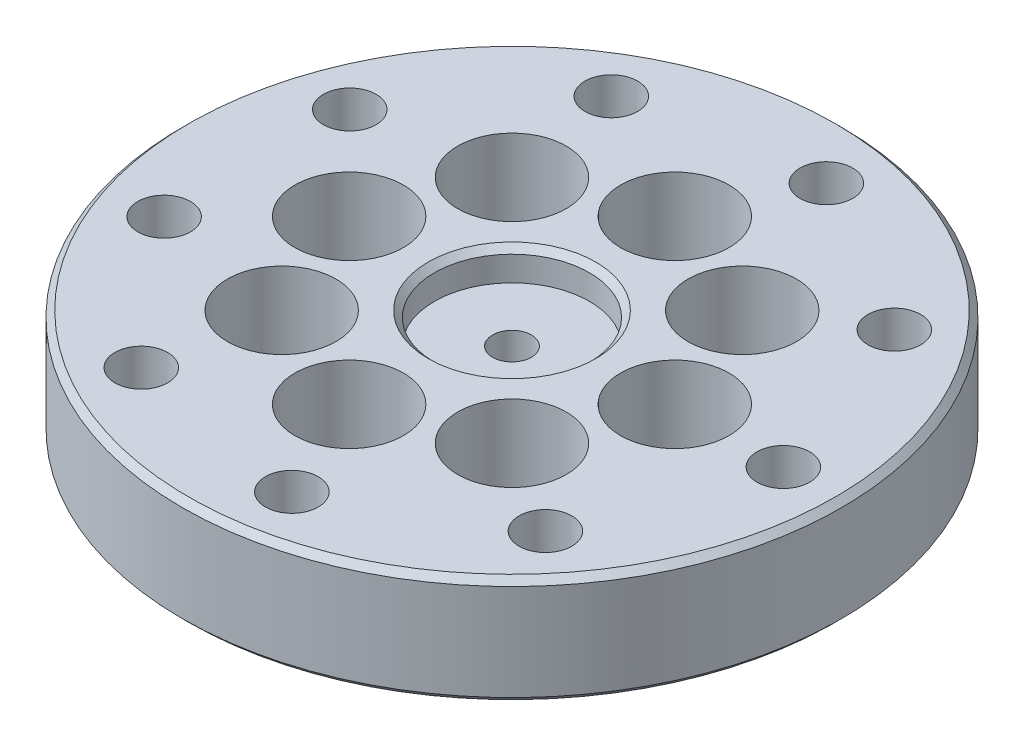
ISO-10303-21;
HEADER;
FILE_DESCRIPTION(('STEP AP214'),'2;1');
FILE_NAME('part.step','',(''),(''),'','','');
FILE_SCHEMA(('AUTOMOTIVE_DESIGN { 1 0 10303 214 1 1 1 1 }'));
ENDSEC;
DATA;
#1=APPLICATION_CONTEXT('core data for automotive mechanical design processes');
#2=APPLICATION_PROTOCOL_DEFINITION('international standard','automotive_design',2000,#1);
#3=PRODUCT_CONTEXT('',#1,'mechanical');
#4=PRODUCT('Part','Part','',(#3));
#5=PRODUCT_RELATED_PRODUCT_CATEGORY('part','',(#4));
#6=PRODUCT_DEFINITION_FORMATION('','',#4);
#7=PRODUCT_DEFINITION_CONTEXT('part definition',#1,'design');
#8=PRODUCT_DEFINITION('design','',#6,#7);
#9=PRODUCT_DEFINITION_SHAPE('','',#8);
#10=(LENGTH_UNIT() NAMED_UNIT(*) SI_UNIT(.MILLI.,.METRE.));
#11=(NAMED_UNIT(*) PLANE_ANGLE_UNIT() SI_UNIT($,.RADIAN.));
#12=(NAMED_UNIT(*) SI_UNIT($,.STERADIAN.) SOLID_ANGLE_UNIT());
#13=UNCERTAINTY_MEASURE_WITH_UNIT(LENGTH_MEASURE(1.E-05),#10,'distance_accuracy_value','');
#14=(GEOMETRIC_REPRESENTATION_CONTEXT(3) GLOBAL_UNCERTAINTY_ASSIGNED_CONTEXT((#13)) GLOBAL_UNIT_ASSIGNED_CONTEXT((#10,
#11,#12)) REPRESENTATION_CONTEXT('',''));
#15=CARTESIAN_POINT('',(0.,0.,0.));
#16=DIRECTION('',(0.,0.,1.));
#17=DIRECTION('',(1.,0.,0.));
#18=AXIS2_PLACEMENT_3D('',#15,#16,#17);
#19=CARTESIAN_POINT('',(0.,10.,0.));
#20=DIRECTION('',(0.,1.,0.));
#21=DIRECTION('',(0.,0.,-1.));
#22=AXIS2_PLACEMENT_3D('',#19,#20,#21);
#23=PLANE('',#22);
#24=CARTESIAN_POINT('',(0.,10.,0.));
#25=DIRECTION('',(0.,1.,0.));
#26=DIRECTION('',(0.,0.,1.));
#27=AXIS2_PLACEMENT_3D('',#24,#25,#26);
#28=CIRCLE('',#27,10.);
#29=CARTESIAN_POINT('',(0.,10.,10.));
#30=VERTEX_POINT('',#29);
#31=EDGE_CURVE('E11',#30,#30,#28,.T.);
#32=ORIENTED_EDGE('',*,*,#31,.T.);
#33=EDGE_LOOP('',(#32));
#34=FACE_BOUND('',#33,.T.);
#35=CARTESIAN_POINT('',(0.,10.,0.));
#36=DIRECTION('',(0.,-1.,0.));
#37=DIRECTION('',(0.,0.,1.));
#38=AXIS2_PLACEMENT_3D('',#35,#36,#37);
#39=CIRCLE('',#38,2.5);
#40=CARTESIAN_POINT('',(0.,10.,2.5));
#41=VERTEX_POINT('',#40);
#42=EDGE_CURVE('E28',#41,#41,#39,.T.);
#43=ORIENTED_EDGE('',*,*,#42,.T.);
#44=EDGE_LOOP('',(#43));
#45=FACE_BOUND('',#44,.T.);
#46=ADVANCED_FACE('F17',(#34,#45),#23,.T.);
#47=CARTESIAN_POINT('',(0.,10.,0.));
#48=DIRECTION('',(0.,1.,0.));
#49=DIRECTION('',(0.,0.,-1.));
#50=AXIS2_PLACEMENT_3D('',#47,#48,#49);
#51=CYLINDRICAL_SURFACE('',#50,10.);
#52=ORIENTED_EDGE('',*,*,#31,.F.);
#53=EDGE_LOOP('',(#52));
#54=FACE_BOUND('',#53,.T.);
#55=CARTESIAN_POINT('',(0.,13.2,0.));
#56=DIRECTION('',(0.,1.,0.));
#57=DIRECTION('',(0.,0.,1.));
#58=AXIS2_PLACEMENT_3D('',#55,#56,#57);
#59=CIRCLE('',#58,10.);
#60=CARTESIAN_POINT('',(0.,13.2,10.));
#61=VERTEX_POINT('',#60);
#62=EDGE_CURVE('E575',#61,#61,#59,.T.);
#63=ORIENTED_EDGE('',*,*,#62,.T.);
#64=EDGE_LOOP('',(#63));
#65=FACE_BOUND('',#64,.T.);
#66=ADVANCED_FACE('F335',(#54,#65),#51,.F.);
#67=CARTESIAN_POINT('',(0.,10.,0.));
#68=DIRECTION('',(0.,1.,0.));
#69=DIRECTION('',(0.,0.,-1.));
#70=AXIS2_PLACEMENT_3D('',#67,#68,#69);
#71=CYLINDRICAL_SURFACE('',#70,2.5);
#72=ORIENTED_EDGE('',*,*,#42,.F.);
#73=EDGE_LOOP('',(#72));
#74=FACE_BOUND('',#73,.T.);
#75=CARTESIAN_POINT('',(0.,-4.,0.));
#76=DIRECTION('',(0.,1.,0.));
#77=DIRECTION('',(0.,0.,1.));
#78=AXIS2_PLACEMENT_3D('',#75,#76,#77);
#79=CIRCLE('',#78,2.5);
#80=CARTESIAN_POINT('',(0.,-4.,2.5));
#81=VERTEX_POINT('',#80);
#82=EDGE_CURVE('E459',#81,#81,#79,.T.);
#83=ORIENTED_EDGE('',*,*,#82,.F.);
#84=EDGE_LOOP('',(#83));
#85=FACE_BOUND('',#84,.T.);
#86=ADVANCED_FACE('F341',(#74,#85),#71,.F.);
#87=CARTESIAN_POINT('',(0.,14.,0.));
#88=DIRECTION('',(0.,1.,0.));
#89=DIRECTION('',(1.,0.,0.));
#90=AXIS2_PLACEMENT_3D('',#87,#88,#89);
#91=CONICAL_SURFACE('',#90,10.8,0.785398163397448);
#92=ORIENTED_EDGE('',*,*,#62,.F.);
#93=EDGE_LOOP('',(#92));
#94=FACE_BOUND('',#93,.T.);
#95=CARTESIAN_POINT('',(0.,14.,0.));
#96=DIRECTION('',(0.,-1.,0.));
#97=DIRECTION('',(-1.,0.,0.));
#98=AXIS2_PLACEMENT_3D('',#95,#96,#97);
#99=CIRCLE('',#98,10.8);
#100=CARTESIAN_POINT('',(-10.8,14.,0.));
#101=VERTEX_POINT('',#100);
#102=EDGE_CURVE('E450',#101,#101,#99,.T.);
#103=ORIENTED_EDGE('',*,*,#102,.F.);
#104=EDGE_LOOP('',(#103));
#105=FACE_BOUND('',#104,.T.);
#106=ADVANCED_FACE('F347',(#94,#105),#91,.F.);
#107=CARTESIAN_POINT('',(-14.8492424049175,4.,-14.8492424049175));
#108=DIRECTION('',(0.,1.,0.));
#109=DIRECTION('',(0.,0.,-1.));
#110=AXIS2_PLACEMENT_3D('',#107,#108,#109);
#111=CYLINDRICAL_SURFACE('',#110,7.);
#112=CARTESIAN_POINT('',(-14.8492424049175,14.,-14.8492424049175));
#113=DIRECTION('',(0.,-1.,0.));
#114=DIRECTION('',(0.,0.,1.));
#115=AXIS2_PLACEMENT_3D('',#112,#113,#114);
#116=CIRCLE('',#115,7.);
#117=CARTESIAN_POINT('',(-14.8492424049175,14.,-7.8492424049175));
#118=VERTEX_POINT('',#117);
#119=EDGE_CURVE('E468',#118,#118,#116,.T.);
#120=ORIENTED_EDGE('',*,*,#119,.F.);
#121=EDGE_LOOP('',(#120));
#122=FACE_BOUND('',#121,.T.);
#123=CARTESIAN_POINT('',(-14.8492424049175,4.,-14.8492424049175));
#124=DIRECTION('',(0.,1.,0.));
#125=DIRECTION('',(0.,0.,1.));
#126=AXIS2_PLACEMENT_3D('',#123,#124,#125);
#127=CIRCLE('',#126,7.);
#128=CARTESIAN_POINT('',(-14.8492424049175,4.,-7.8492424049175));
#129=VERTEX_POINT('',#128);
#130=EDGE_CURVE('E502',#129,#129,#127,.T.);
#131=ORIENTED_EDGE('',*,*,#130,.F.);
#132=EDGE_LOOP('',(#131));
#133=FACE_BOUND('',#132,.T.);
#134=ADVANCED_FACE('F351',(#122,#133),#111,.F.);
#135=CARTESIAN_POINT('',(-21.,4.,0.));
#136=DIRECTION('',(0.,1.,0.));
#137=DIRECTION('',(0.,0.,-1.));
#138=AXIS2_PLACEMENT_3D('',#135,#136,#137);
#139=CYLINDRICAL_SURFACE('',#138,7.);
#140=CARTESIAN_POINT('',(-21.,14.,0.));
#141=DIRECTION('',(0.,-1.,0.));
#142=DIRECTION('',(0.,0.,1.));
#143=AXIS2_PLACEMENT_3D('',#140,#141,#142);
#144=CIRCLE('',#143,7.);
#145=CARTESIAN_POINT('',(-21.,14.,7.));
#146=VERTEX_POINT('',#145);
#147=EDGE_CURVE('E557',#146,#146,#144,.T.);
#148=ORIENTED_EDGE('',*,*,#147,.F.);
#149=EDGE_LOOP('',(#148));
#150=FACE_BOUND('',#149,.T.);
#151=CARTESIAN_POINT('',(-21.,4.,0.));
#152=DIRECTION('',(0.,1.,0.));
#153=DIRECTION('',(0.,0.,1.));
#154=AXIS2_PLACEMENT_3D('',#151,#152,#153);
#155=CIRCLE('',#154,7.);
#156=CARTESIAN_POINT('',(-21.,4.,7.));
#157=VERTEX_POINT('',#156);
#158=EDGE_CURVE('E507',#157,#157,#155,.T.);
#159=ORIENTED_EDGE('',*,*,#158,.F.);
#160=EDGE_LOOP('',(#159));
#161=FACE_BOUND('',#160,.T.);
#162=ADVANCED_FACE('F355',(#150,#161),#139,.F.);
#163=CARTESIAN_POINT('',(-14.8492424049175,4.,14.8492424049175));
#164=DIRECTION('',(0.,1.,0.));
#165=DIRECTION('',(0.,0.,-1.));
#166=AXIS2_PLACEMENT_3D('',#163,#164,#165);
#167=CYLINDRICAL_SURFACE('',#166,7.);
#168=CARTESIAN_POINT('',(-14.8492424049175,14.,14.8492424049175));
#169=DIRECTION('',(0.,-1.,0.));
#170=DIRECTION('',(0.,0.,1.));
#171=AXIS2_PLACEMENT_3D('',#168,#169,#170);
#172=CIRCLE('',#171,7.);
#173=CARTESIAN_POINT('',(-14.8492424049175,14.,21.8492424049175));
#174=VERTEX_POINT('',#173);
#175=EDGE_CURVE('E550',#174,#174,#172,.T.);
#176=ORIENTED_EDGE('',*,*,#175,.F.);
#177=EDGE_LOOP('',(#176));
#178=FACE_BOUND('',#177,.T.);
#179=CARTESIAN_POINT('',(-14.8492424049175,4.,14.8492424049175));
#180=DIRECTION('',(0.,1.,0.));
#181=DIRECTION('',(0.,0.,1.));
#182=AXIS2_PLACEMENT_3D('',#179,#180,#181);
#183=CIRCLE('',#182,7.);
#184=CARTESIAN_POINT('',(-14.8492424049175,4.,21.8492424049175));
#185=VERTEX_POINT('',#184);
#186=EDGE_CURVE('E512',#185,#185,#183,.T.);
#187=ORIENTED_EDGE('',*,*,#186,.F.);
#188=EDGE_LOOP('',(#187));
#189=FACE_BOUND('',#188,.T.);
#190=ADVANCED_FACE('F359',(#178,#189),#167,.F.);
#191=CARTESIAN_POINT('',(0.,4.,21.));
#192=DIRECTION('',(0.,1.,0.));
#193=DIRECTION('',(0.,0.,-1.));
#194=AXIS2_PLACEMENT_3D('',#191,#192,#193);
#195=CYLINDRICAL_SURFACE('',#194,7.);
#196=CARTESIAN_POINT('',(0.,14.,21.));
#197=DIRECTION('',(0.,-1.,0.));
#198=DIRECTION('',(0.,0.,1.));
#199=AXIS2_PLACEMENT_3D('',#196,#197,#198);
#200=CIRCLE('',#199,7.);
#201=CARTESIAN_POINT('',(0.,14.,28.));
#202=VERTEX_POINT('',#201);
#203=EDGE_CURVE('E543',#202,#202,#200,.T.);
#204=ORIENTED_EDGE('',*,*,#203,.F.);
#205=EDGE_LOOP('',(#204));
#206=FACE_BOUND('',#205,.T.);
#207=CARTESIAN_POINT('',(0.,4.,21.));
#208=DIRECTION('',(0.,1.,0.));
#209=DIRECTION('',(0.,0.,1.));
#210=AXIS2_PLACEMENT_3D('',#207,#208,#209);
#211=CIRCLE('',#210,7.);
#212=CARTESIAN_POINT('',(0.,4.,28.));
#213=VERTEX_POINT('',#212);
#214=EDGE_CURVE('E517',#213,#213,#211,.T.);
#215=ORIENTED_EDGE('',*,*,#214,.F.);
#216=EDGE_LOOP('',(#215));
#217=FACE_BOUND('',#216,.T.);
#218=ADVANCED_FACE('F363',(#206,#217),#195,.F.);
#219=CARTESIAN_POINT('',(14.8492424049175,4.,14.8492424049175));
#220=DIRECTION('',(0.,1.,0.));
#221=DIRECTION('',(0.,0.,-1.));
#222=AXIS2_PLACEMENT_3D('',#219,#220,#221);
#223=CYLINDRICAL_SURFACE('',#222,7.);
#224=CARTESIAN_POINT('',(14.8492424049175,14.,14.8492424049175));
#225=DIRECTION('',(0.,-1.,0.));
#226=DIRECTION('',(0.,0.,1.));
#227=AXIS2_PLACEMENT_3D('',#224,#225,#226);
#228=CIRCLE('',#227,7.);
#229=CARTESIAN_POINT('',(14.8492424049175,14.,21.8492424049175));
#230=VERTEX_POINT('',#229);
#231=EDGE_CURVE('E538',#230,#230,#228,.T.);
#232=ORIENTED_EDGE('',*,*,#231,.F.);
#233=EDGE_LOOP('',(#232));
#234=FACE_BOUND('',#233,.T.);
#235=CARTESIAN_POINT('',(14.8492424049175,4.,14.8492424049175));
#236=DIRECTION('',(0.,1.,0.));
#237=DIRECTION('',(0.,0.,1.));
#238=AXIS2_PLACEMENT_3D('',#235,#236,#237);
#239=CIRCLE('',#238,7.);
#240=CARTESIAN_POINT('',(14.8492424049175,4.,21.8492424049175));
#241=VERTEX_POINT('',#240);
#242=EDGE_CURVE('E521',#241,#241,#239,.T.);
#243=ORIENTED_EDGE('',*,*,#242,.F.);
#244=EDGE_LOOP('',(#243));
#245=FACE_BOUND('',#244,.T.);
#246=ADVANCED_FACE('F367',(#234,#245),#223,.F.);
#247=CARTESIAN_POINT('',(21.,4.,0.));
#248=DIRECTION('',(0.,1.,0.));
#249=DIRECTION('',(0.,0.,-1.));
#250=AXIS2_PLACEMENT_3D('',#247,#248,#249);
#251=CYLINDRICAL_SURFACE('',#250,7.);
#252=CARTESIAN_POINT('',(21.,14.,0.));
#253=DIRECTION('',(0.,-1.,0.));
#254=DIRECTION('',(0.,0.,1.));
#255=AXIS2_PLACEMENT_3D('',#252,#253,#254);
#256=CIRCLE('',#255,7.);
#257=CARTESIAN_POINT('',(21.,14.,7.));
#258=VERTEX_POINT('',#257);
#259=EDGE_CURVE('E535',#258,#258,#256,.T.);
#260=ORIENTED_EDGE('',*,*,#259,.F.);
#261=EDGE_LOOP('',(#260));
#262=FACE_BOUND('',#261,.T.);
#263=CARTESIAN_POINT('',(21.,4.,0.));
#264=DIRECTION('',(0.,1.,0.));
#265=DIRECTION('',(0.,0.,1.));
#266=AXIS2_PLACEMENT_3D('',#263,#264,#265);
#267=CIRCLE('',#266,7.);
#268=CARTESIAN_POINT('',(21.,4.,7.));
#269=VERTEX_POINT('',#268);
#270=EDGE_CURVE('E437',#269,#269,#267,.T.);
#271=ORIENTED_EDGE('',*,*,#270,.F.);
#272=EDGE_LOOP('',(#271));
#273=FACE_BOUND('',#272,.T.);
#274=ADVANCED_FACE('F371',(#262,#273),#251,.F.);
#275=CARTESIAN_POINT('',(14.8492424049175,4.,-14.8492424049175));
#276=DIRECTION('',(0.,1.,0.));
#277=DIRECTION('',(0.,0.,-1.));
#278=AXIS2_PLACEMENT_3D('',#275,#276,#277);
#279=CYLINDRICAL_SURFACE('',#278,7.);
#280=CARTESIAN_POINT('',(14.8492424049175,14.,-14.8492424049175));
#281=DIRECTION('',(0.,-1.,0.));
#282=DIRECTION('',(0.,0.,1.));
#283=AXIS2_PLACEMENT_3D('',#280,#281,#282);
#284=CIRCLE('',#283,7.);
#285=CARTESIAN_POINT('',(14.8492424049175,14.,-7.8492424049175));
#286=VERTEX_POINT('',#285);
#287=EDGE_CURVE('E444',#286,#286,#284,.T.);
#288=ORIENTED_EDGE('',*,*,#287,.F.);
#289=EDGE_LOOP('',(#288));
#290=FACE_BOUND('',#289,.T.);
#291=CARTESIAN_POINT('',(14.8492424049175,4.,-14.8492424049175));
#292=DIRECTION('',(0.,1.,0.));
#293=DIRECTION('',(0.,0.,1.));
#294=AXIS2_PLACEMENT_3D('',#291,#292,#293);
#295=CIRCLE('',#294,7.);
#296=CARTESIAN_POINT('',(14.8492424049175,4.,-7.8492424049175));
#297=VERTEX_POINT('',#296);
#298=EDGE_CURVE('E428',#297,#297,#295,.T.);
#299=ORIENTED_EDGE('',*,*,#298,.F.);
#300=EDGE_LOOP('',(#299));
#301=FACE_BOUND('',#300,.T.);
#302=ADVANCED_FACE('F375',(#290,#301),#279,.F.);
#303=CARTESIAN_POINT('',(0.,4.,-21.));
#304=DIRECTION('',(0.,1.,0.));
#305=DIRECTION('',(0.,0.,-1.));
#306=AXIS2_PLACEMENT_3D('',#303,#304,#305);
#307=CYLINDRICAL_SURFACE('',#306,7.);
#308=CARTESIAN_POINT('',(0.,14.,-21.));
#309=DIRECTION('',(0.,-1.,0.));
#310=DIRECTION('',(0.,0.,1.));
#311=AXIS2_PLACEMENT_3D('',#308,#309,#310);
#312=CIRCLE('',#311,7.);
#313=CARTESIAN_POINT('',(0.,14.,-14.));
#314=VERTEX_POINT('',#313);
#315=EDGE_CURVE('E446',#314,#314,#312,.T.);
#316=ORIENTED_EDGE('',*,*,#315,.F.);
#317=EDGE_LOOP('',(#316));
#318=FACE_BOUND('',#317,.T.);
#319=CARTESIAN_POINT('',(0.,4.,-21.));
#320=DIRECTION('',(0.,1.,0.));
#321=DIRECTION('',(0.,0.,1.));
#322=AXIS2_PLACEMENT_3D('',#319,#320,#321);
#323=CIRCLE('',#322,7.);
#324=CARTESIAN_POINT('',(0.,4.,-14.));
#325=VERTEX_POINT('',#324);
#326=EDGE_CURVE('E441',#325,#325,#323,.T.);
#327=ORIENTED_EDGE('',*,*,#326,.F.);
#328=EDGE_LOOP('',(#327));
#329=FACE_BOUND('',#328,.T.);
#330=ADVANCED_FACE('F379',(#318,#329),#307,.F.);
#331=CARTESIAN_POINT('',(0.,13.2,0.));
#332=DIRECTION('',(0.,-1.,0.));
#333=DIRECTION('',(0.,0.,1.));
#334=AXIS2_PLACEMENT_3D('',#331,#332,#333);
#335=CONICAL_SURFACE('',#334,42.5,0.785398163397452);
#336=CARTESIAN_POINT('',(0.,14.,0.));
#337=DIRECTION('',(0.,1.,0.));
#338=DIRECTION('',(0.,0.,-1.));
#339=AXIS2_PLACEMENT_3D('',#336,#337,#338);
#340=CIRCLE('',#339,41.7);
#341=CARTESIAN_POINT('',(0.,14.,-41.7));
#342=VERTEX_POINT('',#341);
#343=EDGE_CURVE('E455',#342,#342,#340,.T.);
#344=ORIENTED_EDGE('',*,*,#343,.F.);
#345=EDGE_LOOP('',(#344));
#346=FACE_BOUND('',#345,.T.);
#347=CARTESIAN_POINT('',(0.,13.2,0.));
#348=DIRECTION('',(0.,-1.,0.));
#349=DIRECTION('',(0.,0.,-1.));
#350=AXIS2_PLACEMENT_3D('',#347,#348,#349);
#351=CIRCLE('',#350,42.5);
#352=CARTESIAN_POINT('',(0.,13.2,-42.5));
#353=VERTEX_POINT('',#352);
#354=EDGE_CURVE('E454',#353,#353,#351,.T.);
#355=ORIENTED_EDGE('',*,*,#354,.F.);
#356=EDGE_LOOP('',(#355));
#357=FACE_BOUND('',#356,.T.);
#358=ADVANCED_FACE('F383',(#346,#357),#335,.T.);
#359=CARTESIAN_POINT('',(0.,-4.,0.));
#360=DIRECTION('',(0.,-1.,0.));
#361=DIRECTION('',(0.,0.,1.));
#362=AXIS2_PLACEMENT_3D('',#359,#360,#361);
#363=PLANE('',#362);
#364=CARTESIAN_POINT('',(0.,-4.,0.));
#365=DIRECTION('',(0.,1.,0.));
#366=DIRECTION('',(0.,0.,1.));
#367=AXIS2_PLACEMENT_3D('',#364,#365,#366);
#368=CIRCLE('',#367,9.2);
#369=CARTESIAN_POINT('',(0.,-4.,9.2));
#370=VERTEX_POINT('',#369);
#371=EDGE_CURVE('E242',#370,#370,#368,.T.);
#372=ORIENTED_EDGE('',*,*,#371,.F.);
#373=EDGE_LOOP('',(#372));
#374=FACE_BOUND('',#373,.T.);
#375=ORIENTED_EDGE('',*,*,#82,.T.);
#376=EDGE_LOOP('',(#375));
#377=FACE_BOUND('',#376,.T.);
#378=ADVANCED_FACE('F387',(#374,#377),#363,.T.);
#379=CARTESIAN_POINT('',(0.,14.,0.));
#380=DIRECTION('',(0.,1.,0.));
#381=DIRECTION('',(0.,0.,-1.));
#382=AXIS2_PLACEMENT_3D('',#379,#380,#381);
#383=PLANE('',#382);
#384=ORIENTED_EDGE('',*,*,#343,.T.);
#385=EDGE_LOOP('',(#384));
#386=FACE_BOUND('',#385,.T.);
#387=ORIENTED_EDGE('',*,*,#102,.T.);
#388=EDGE_LOOP('',(#387));
#389=FACE_BOUND('',#388,.T.);
#390=ORIENTED_EDGE('',*,*,#315,.T.);
#391=EDGE_LOOP('',(#390));
#392=FACE_BOUND('',#391,.T.);
#393=ORIENTED_EDGE('',*,*,#287,.T.);
#394=EDGE_LOOP('',(#393));
#395=FACE_BOUND('',#394,.T.);
#396=ORIENTED_EDGE('',*,*,#259,.T.);
#397=EDGE_LOOP('',(#396));
#398=FACE_BOUND('',#397,.T.);
#399=ORIENTED_EDGE('',*,*,#231,.T.);
#400=EDGE_LOOP('',(#399));
#401=FACE_BOUND('',#400,.T.);
#402=ORIENTED_EDGE('',*,*,#203,.T.);
#403=EDGE_LOOP('',(#402));
#404=FACE_BOUND('',#403,.T.);
#405=ORIENTED_EDGE('',*,*,#175,.T.);
#406=EDGE_LOOP('',(#405));
#407=FACE_BOUND('',#406,.T.);
#408=ORIENTED_EDGE('',*,*,#147,.T.);
#409=EDGE_LOOP('',(#408));
#410=FACE_BOUND('',#409,.T.);
#411=ORIENTED_EDGE('',*,*,#119,.T.);
#412=EDGE_LOOP('',(#411));
#413=FACE_BOUND('',#412,.T.);
#414=CARTESIAN_POINT('',(-17.5,14.,-30.3108891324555));
#415=DIRECTION('',(0.,-1.,0.));
#416=DIRECTION('',(0.,0.,1.));
#417=AXIS2_PLACEMENT_3D('',#414,#415,#416);
#418=CIRCLE('',#417,3.4);
#419=CARTESIAN_POINT('',(-17.5,14.,-26.9108891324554));
#420=VERTEX_POINT('',#419);
#421=EDGE_CURVE('E464',#420,#420,#418,.T.);
#422=ORIENTED_EDGE('',*,*,#421,.T.);
#423=EDGE_LOOP('',(#422));
#424=FACE_BOUND('',#423,.T.);
#425=CARTESIAN_POINT('',(6.07768621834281,14.,-34.4682713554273));
#426=DIRECTION('',(0.,-1.,0.));
#427=DIRECTION('',(0.,0.,1.));
#428=AXIS2_PLACEMENT_3D('',#425,#426,#427);
#429=CIRCLE('',#428,3.4);
#430=CARTESIAN_POINT('',(6.07768621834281,14.,-31.0682713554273));
#431=VERTEX_POINT('',#430);
#432=EDGE_CURVE('E469',#431,#431,#429,.T.);
#433=ORIENTED_EDGE('',*,*,#432,.T.);
#434=EDGE_LOOP('',(#433));
#435=FACE_BOUND('',#434,.T.);
#436=CARTESIAN_POINT('',(26.8115555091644,14.,-22.4975663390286));
#437=DIRECTION('',(0.,-1.,0.));
#438=DIRECTION('',(0.,0.,1.));
#439=AXIS2_PLACEMENT_3D('',#436,#437,#438);
#440=CIRCLE('',#439,3.4);
#441=CARTESIAN_POINT('',(26.8115555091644,14.,-19.0975663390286));
#442=VERTEX_POINT('',#441);
#443=EDGE_CURVE('E473',#442,#442,#440,.T.);
#444=ORIENTED_EDGE('',*,*,#443,.T.);
#445=EDGE_LOOP('',(#444));
#446=FACE_BOUND('',#445,.T.);
#447=CARTESIAN_POINT('',(35.,14.,3.6429192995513E-13));
#448=DIRECTION('',(0.,-1.,0.));
#449=DIRECTION('',(0.,0.,1.));
#450=AXIS2_PLACEMENT_3D('',#447,#448,#449);
#451=CIRCLE('',#450,3.4);
#452=CARTESIAN_POINT('',(35.,14.,3.40000000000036));
#453=VERTEX_POINT('',#452);
#454=EDGE_CURVE('E477',#453,#453,#451,.T.);
#455=ORIENTED_EDGE('',*,*,#454,.T.);
#456=EDGE_LOOP('',(#455));
#457=FACE_BOUND('',#456,.T.);
#458=CARTESIAN_POINT('',(26.811555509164,14.,22.4975663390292));
#459=DIRECTION('',(0.,-1.,0.));
#460=DIRECTION('',(0.,0.,1.));
#461=AXIS2_PLACEMENT_3D('',#458,#459,#460);
#462=CIRCLE('',#461,3.4);
#463=CARTESIAN_POINT('',(26.811555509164,14.,25.8975663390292));
#464=VERTEX_POINT('',#463);
#465=EDGE_CURVE('E481',#464,#464,#462,.T.);
#466=ORIENTED_EDGE('',*,*,#465,.T.);
#467=EDGE_LOOP('',(#466));
#468=FACE_BOUND('',#467,.T.);
#469=CARTESIAN_POINT('',(6.07768621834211,14.,34.4682713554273));
#470=DIRECTION('',(0.,-1.,0.));
#471=DIRECTION('',(0.,0.,1.));
#472=AXIS2_PLACEMENT_3D('',#469,#470,#471);
#473=CIRCLE('',#472,3.4);
#474=CARTESIAN_POINT('',(6.07768621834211,14.,37.8682713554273));
#475=VERTEX_POINT('',#474);
#476=EDGE_CURVE('E485',#475,#475,#473,.T.);
#477=ORIENTED_EDGE('',*,*,#476,.T.);
#478=EDGE_LOOP('',(#477));
#479=FACE_BOUND('',#478,.T.);
#480=CARTESIAN_POINT('',(-17.5000000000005,14.,30.3108891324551));
#481=DIRECTION('',(0.,-1.,0.));
#482=DIRECTION('',(0.,0.,1.));
#483=AXIS2_PLACEMENT_3D('',#480,#481,#482);
#484=CIRCLE('',#483,3.4);
#485=CARTESIAN_POINT('',(-17.5000000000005,14.,33.7108891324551));
#486=VERTEX_POINT('',#485);
#487=EDGE_CURVE('E488',#486,#486,#484,.T.);
#488=ORIENTED_EDGE('',*,*,#487,.T.);
#489=EDGE_LOOP('',(#488));
#490=FACE_BOUND('',#489,.T.);
#491=CARTESIAN_POINT('',(-32.889241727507,14.,11.9707050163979));
#492=DIRECTION('',(0.,-1.,0.));
#493=DIRECTION('',(0.,0.,1.));
#494=AXIS2_PLACEMENT_3D('',#491,#492,#493);
#495=CIRCLE('',#494,3.4);
#496=CARTESIAN_POINT('',(-32.889241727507,14.,15.3707050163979));
#497=VERTEX_POINT('',#496);
#498=EDGE_CURVE('E492',#497,#497,#495,.T.);
#499=ORIENTED_EDGE('',*,*,#498,.T.);
#500=EDGE_LOOP('',(#499));
#501=FACE_BOUND('',#500,.T.);
#502=CARTESIAN_POINT('',(-32.8892417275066,14.,-11.970705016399));
#503=DIRECTION('',(0.,-1.,0.));
#504=DIRECTION('',(0.,0.,1.));
#505=AXIS2_PLACEMENT_3D('',#502,#503,#504);
#506=CIRCLE('',#505,3.4);
#507=CARTESIAN_POINT('',(-32.8892417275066,14.,-8.570705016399));
#508=VERTEX_POINT('',#507);
#509=EDGE_CURVE('E496',#508,#508,#506,.T.);
#510=ORIENTED_EDGE('',*,*,#509,.T.);
#511=EDGE_LOOP('',(#510));
#512=FACE_BOUND('',#511,.T.);
#513=ADVANCED_FACE('F391',(#386,#389,#392,#395,#398,#401,#404,#407,#410,#413,#424,#435,#446,
#457,#468,#479,#490,#501,#512),#383,.T.);
#514=CARTESIAN_POINT('',(-14.8492424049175,4.,-14.8492424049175));
#515=DIRECTION('',(0.,1.,0.));
#516=DIRECTION('',(0.,0.,-1.));
#517=AXIS2_PLACEMENT_3D('',#514,#515,#516);
#518=PLANE('',#517);
#519=CARTESIAN_POINT('',(-14.8492424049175,4.,-14.8492424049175));
#520=DIRECTION('',(0.,-1.,0.));
#521=DIRECTION('',(0.,0.,1.));
#522=AXIS2_PLACEMENT_3D('',#519,#520,#521);
#523=CIRCLE('',#522,4.25);
#524=CARTESIAN_POINT('',(-14.8492424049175,4.,-10.5992424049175));
#525=VERTEX_POINT('',#524);
#526=EDGE_CURVE('E499',#525,#525,#523,.T.);
#527=ORIENTED_EDGE('',*,*,#526,.T.);
#528=EDGE_LOOP('',(#527));
#529=FACE_BOUND('',#528,.T.);
#530=ORIENTED_EDGE('',*,*,#130,.T.);
#531=EDGE_LOOP('',(#530));
#532=FACE_BOUND('',#531,.T.);
#533=ADVANCED_FACE('F395',(#529,#532),#518,.T.);
#534=CARTESIAN_POINT('',(-21.,4.,0.));
#535=DIRECTION('',(0.,1.,0.));
#536=DIRECTION('',(0.,0.,-1.));
#537=AXIS2_PLACEMENT_3D('',#534,#535,#536);
#538=PLANE('',#537);
#539=CARTESIAN_POINT('',(-21.,4.,0.));
#540=DIRECTION('',(0.,-1.,0.));
#541=DIRECTION('',(0.,0.,1.));
#542=AXIS2_PLACEMENT_3D('',#539,#540,#541);
#543=CIRCLE('',#542,4.25);
#544=CARTESIAN_POINT('',(-21.,4.,4.25));
#545=VERTEX_POINT('',#544);
#546=EDGE_CURVE('E503',#545,#545,#543,.T.);
#547=ORIENTED_EDGE('',*,*,#546,.T.);
#548=EDGE_LOOP('',(#547));
#549=FACE_BOUND('',#548,.T.);
#550=ORIENTED_EDGE('',*,*,#158,.T.);
#551=EDGE_LOOP('',(#550));
#552=FACE_BOUND('',#551,.T.);
#553=ADVANCED_FACE('F399',(#549,#552),#538,.T.);
#554=CARTESIAN_POINT('',(-14.8492424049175,4.,14.8492424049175));
#555=DIRECTION('',(0.,1.,0.));
#556=DIRECTION('',(0.,0.,-1.));
#557=AXIS2_PLACEMENT_3D('',#554,#555,#556);
#558=PLANE('',#557);
#559=CARTESIAN_POINT('',(-14.8492424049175,4.,14.8492424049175));
#560=DIRECTION('',(0.,-1.,0.));
#561=DIRECTION('',(0.,0.,1.));
#562=AXIS2_PLACEMENT_3D('',#559,#560,#561);
#563=CIRCLE('',#562,4.25);
#564=CARTESIAN_POINT('',(-14.8492424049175,4.,19.0992424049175));
#565=VERTEX_POINT('',#564);
#566=EDGE_CURVE('E508',#565,#565,#563,.T.);
#567=ORIENTED_EDGE('',*,*,#566,.T.);
#568=EDGE_LOOP('',(#567));
#569=FACE_BOUND('',#568,.T.);
#570=ORIENTED_EDGE('',*,*,#186,.T.);
#571=EDGE_LOOP('',(#570));
#572=FACE_BOUND('',#571,.T.);
#573=ADVANCED_FACE('F403',(#569,#572),#558,.T.);
#574=CARTESIAN_POINT('',(0.,4.,21.));
#575=DIRECTION('',(0.,1.,0.));
#576=DIRECTION('',(0.,0.,-1.));
#577=AXIS2_PLACEMENT_3D('',#574,#575,#576);
#578=PLANE('',#577);
#579=CARTESIAN_POINT('',(0.,4.,21.));
#580=DIRECTION('',(0.,-1.,0.));
#581=DIRECTION('',(0.,0.,1.));
#582=AXIS2_PLACEMENT_3D('',#579,#580,#581);
#583=CIRCLE('',#582,4.25);
#584=CARTESIAN_POINT('',(0.,4.,25.25));
#585=VERTEX_POINT('',#584);
#586=EDGE_CURVE('E513',#585,#585,#583,.T.);
#587=ORIENTED_EDGE('',*,*,#586,.T.);
#588=EDGE_LOOP('',(#587));
#589=FACE_BOUND('',#588,.T.);
#590=ORIENTED_EDGE('',*,*,#214,.T.);
#591=EDGE_LOOP('',(#590));
#592=FACE_BOUND('',#591,.T.);
#593=ADVANCED_FACE('F407',(#589,#592),#578,.T.);
#594=CARTESIAN_POINT('',(14.8492424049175,4.,14.8492424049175));
#595=DIRECTION('',(0.,1.,0.));
#596=DIRECTION('',(0.,0.,-1.));
#597=AXIS2_PLACEMENT_3D('',#594,#595,#596);
#598=PLANE('',#597);
#599=CARTESIAN_POINT('',(14.8492424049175,4.,14.8492424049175));
#600=DIRECTION('',(0.,-1.,0.));
#601=DIRECTION('',(0.,0.,1.));
#602=AXIS2_PLACEMENT_3D('',#599,#600,#601);
#603=CIRCLE('',#602,4.25);
#604=CARTESIAN_POINT('',(14.8492424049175,4.,19.0992424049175));
#605=VERTEX_POINT('',#604);
#606=EDGE_CURVE('E518',#605,#605,#603,.T.);
#607=ORIENTED_EDGE('',*,*,#606,.T.);
#608=EDGE_LOOP('',(#607));
#609=FACE_BOUND('',#608,.T.);
#610=ORIENTED_EDGE('',*,*,#242,.T.);
#611=EDGE_LOOP('',(#610));
#612=FACE_BOUND('',#611,.T.);
#613=ADVANCED_FACE('F411',(#609,#612),#598,.T.);
#614=CARTESIAN_POINT('',(21.,4.,0.));
#615=DIRECTION('',(0.,1.,0.));
#616=DIRECTION('',(0.,0.,-1.));
#617=AXIS2_PLACEMENT_3D('',#614,#615,#616);
#618=PLANE('',#617);
#619=CARTESIAN_POINT('',(21.,4.,0.));
#620=DIRECTION('',(0.,-1.,0.));
#621=DIRECTION('',(0.,0.,1.));
#622=AXIS2_PLACEMENT_3D('',#619,#620,#621);
#623=CIRCLE('',#622,4.25);
#624=CARTESIAN_POINT('',(21.,4.,4.25));
#625=VERTEX_POINT('',#624);
#626=EDGE_CURVE('E522',#625,#625,#623,.T.);
#627=ORIENTED_EDGE('',*,*,#626,.T.);
#628=EDGE_LOOP('',(#627));
#629=FACE_BOUND('',#628,.T.);
#630=ORIENTED_EDGE('',*,*,#270,.T.);
#631=EDGE_LOOP('',(#630));
#632=FACE_BOUND('',#631,.T.);
#633=ADVANCED_FACE('F415',(#629,#632),#618,.T.);
#634=CARTESIAN_POINT('',(14.8492424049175,4.,-14.8492424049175));
#635=DIRECTION('',(0.,1.,0.));
#636=DIRECTION('',(0.,0.,-1.));
#637=AXIS2_PLACEMENT_3D('',#634,#635,#636);
#638=PLANE('',#637);
#639=CARTESIAN_POINT('',(14.8492424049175,4.,-14.8492424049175));
#640=DIRECTION('',(0.,-1.,0.));
#641=DIRECTION('',(0.,0.,1.));
#642=AXIS2_PLACEMENT_3D('',#639,#640,#641);
#643=CIRCLE('',#642,4.25);
#644=CARTESIAN_POINT('',(14.8492424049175,4.,-10.5992424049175));
#645=VERTEX_POINT('',#644);
#646=EDGE_CURVE('E426',#645,#645,#643,.T.);
#647=ORIENTED_EDGE('',*,*,#646,.T.);
#648=EDGE_LOOP('',(#647));
#649=FACE_BOUND('',#648,.T.);
#650=ORIENTED_EDGE('',*,*,#298,.T.);
#651=EDGE_LOOP('',(#650));
#652=FACE_BOUND('',#651,.T.);
#653=ADVANCED_FACE('F330',(#649,#652),#638,.T.);
#654=CARTESIAN_POINT('',(0.,4.,-21.));
#655=DIRECTION('',(0.,1.,0.));
#656=DIRECTION('',(0.,0.,-1.));
#657=AXIS2_PLACEMENT_3D('',#654,#655,#656);
#658=PLANE('',#657);
#659=CARTESIAN_POINT('',(0.,4.,-21.));
#660=DIRECTION('',(0.,-1.,0.));
#661=DIRECTION('',(0.,0.,1.));
#662=AXIS2_PLACEMENT_3D('',#659,#660,#661);
#663=CIRCLE('',#662,4.25);
#664=CARTESIAN_POINT('',(0.,4.,-16.75));
#665=VERTEX_POINT('',#664);
#666=EDGE_CURVE('E431',#665,#665,#663,.T.);
#667=ORIENTED_EDGE('',*,*,#666,.T.);
#668=EDGE_LOOP('',(#667));
#669=FACE_BOUND('',#668,.T.);
#670=ORIENTED_EDGE('',*,*,#326,.T.);
#671=EDGE_LOOP('',(#670));
#672=FACE_BOUND('',#671,.T.);
#673=ADVANCED_FACE('F319',(#669,#672),#658,.T.);
#674=CARTESIAN_POINT('',(0.,14.,0.));
#675=DIRECTION('',(0.,-1.,0.));
#676=DIRECTION('',(0.,0.,1.));
#677=AXIS2_PLACEMENT_3D('',#674,#675,#676);
#678=CYLINDRICAL_SURFACE('',#677,42.5);
#679=ORIENTED_EDGE('',*,*,#354,.T.);
#680=EDGE_LOOP('',(#679));
#681=FACE_BOUND('',#680,.T.);
#682=CARTESIAN_POINT('',(0.,0.799999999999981,0.));
#683=DIRECTION('',(0.,-1.,0.));
#684=DIRECTION('',(0.,0.,1.));
#685=AXIS2_PLACEMENT_3D('',#682,#683,#684);
#686=CIRCLE('',#685,42.5);
#687=CARTESIAN_POINT('',(0.,0.799999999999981,42.5));
#688=VERTEX_POINT('',#687);
#689=EDGE_CURVE('E227',#688,#688,#686,.T.);
#690=ORIENTED_EDGE('',*,*,#689,.F.);
#691=EDGE_LOOP('',(#690));
#692=FACE_BOUND('',#691,.T.);
#693=ADVANCED_FACE('F316',(#681,#692),#678,.T.);
#694=CARTESIAN_POINT('',(0.,-3.2,0.));
#695=DIRECTION('',(0.,1.,0.));
#696=DIRECTION('',(0.,0.,-1.));
#697=AXIS2_PLACEMENT_3D('',#694,#695,#696);
#698=CONICAL_SURFACE('',#697,10.,0.785398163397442);
#699=ORIENTED_EDGE('',*,*,#371,.T.);
#700=EDGE_LOOP('',(#699));
#701=FACE_BOUND('',#700,.T.);
#702=CARTESIAN_POINT('',(0.,-3.2,0.));
#703=DIRECTION('',(0.,1.,0.));
#704=DIRECTION('',(0.,0.,1.));
#705=AXIS2_PLACEMENT_3D('',#702,#703,#704);
#706=CIRCLE('',#705,10.);
#707=CARTESIAN_POINT('',(0.,-3.2,10.));
#708=VERTEX_POINT('',#707);
#709=EDGE_CURVE('E220',#708,#708,#706,.T.);
#710=ORIENTED_EDGE('',*,*,#709,.F.);
#711=EDGE_LOOP('',(#710));
#712=FACE_BOUND('',#711,.T.);
#713=ADVANCED_FACE('F318',(#701,#712),#698,.T.);
#714=CARTESIAN_POINT('',(-32.8892417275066,14.,-11.970705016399));
#715=DIRECTION('',(0.,1.,0.));
#716=DIRECTION('',(0.,0.,-1.));
#717=AXIS2_PLACEMENT_3D('',#714,#715,#716);
#718=CYLINDRICAL_SURFACE('',#717,3.4);
#719=CARTESIAN_POINT('',(-32.8892417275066,0.,-11.970705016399));
#720=DIRECTION('',(0.,-1.,0.));
#721=DIRECTION('',(0.,0.,1.));
#722=AXIS2_PLACEMENT_3D('',#719,#720,#721);
#723=CIRCLE('',#722,3.4);
#724=CARTESIAN_POINT('',(-32.8892417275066,0.,-8.570705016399));
#725=VERTEX_POINT('',#724);
#726=EDGE_CURVE('E238',#725,#725,#723,.T.);
#727=ORIENTED_EDGE('',*,*,#726,.T.);
#728=EDGE_LOOP('',(#727));
#729=FACE_BOUND('',#728,.T.);
#730=ORIENTED_EDGE('',*,*,#509,.F.);
#731=EDGE_LOOP('',(#730));
#732=FACE_BOUND('',#731,.T.);
#733=ADVANCED_FACE('F327',(#729,#732),#718,.F.);
#734=CARTESIAN_POINT('',(-32.889241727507,14.,11.9707050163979));
#735=DIRECTION('',(0.,1.,0.));
#736=DIRECTION('',(0.,0.,-1.));
#737=AXIS2_PLACEMENT_3D('',#734,#735,#736);
#738=CYLINDRICAL_SURFACE('',#737,3.4);
#739=CARTESIAN_POINT('',(-32.889241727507,0.,11.9707050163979));
#740=DIRECTION('',(0.,-1.,0.));
#741=DIRECTION('',(0.,0.,1.));
#742=AXIS2_PLACEMENT_3D('',#739,#740,#741);
#743=CIRCLE('',#742,3.4);
#744=CARTESIAN_POINT('',(-32.889241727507,0.,15.3707050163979));
#745=VERTEX_POINT('',#744);
#746=EDGE_CURVE('E243',#745,#745,#743,.T.);
#747=ORIENTED_EDGE('',*,*,#746,.T.);
#748=EDGE_LOOP('',(#747));
#749=FACE_BOUND('',#748,.T.);
#750=ORIENTED_EDGE('',*,*,#498,.F.);
#751=EDGE_LOOP('',(#750));
#752=FACE_BOUND('',#751,.T.);
#753=ADVANCED_FACE('F828',(#749,#752),#738,.F.);
#754=CARTESIAN_POINT('',(-17.5000000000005,14.,30.3108891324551));
#755=DIRECTION('',(0.,1.,0.));
#756=DIRECTION('',(0.,0.,-1.));
#757=AXIS2_PLACEMENT_3D('',#754,#755,#756);
#758=CYLINDRICAL_SURFACE('',#757,3.4);
#759=CARTESIAN_POINT('',(-17.5000000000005,0.,30.3108891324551));
#760=DIRECTION('',(0.,-1.,0.));
#761=DIRECTION('',(0.,0.,1.));
#762=AXIS2_PLACEMENT_3D('',#759,#760,#761);
#763=CIRCLE('',#762,3.4);
#764=CARTESIAN_POINT('',(-17.5000000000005,0.,33.7108891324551));
#765=VERTEX_POINT('',#764);
#766=EDGE_CURVE('E247',#765,#765,#763,.T.);
#767=ORIENTED_EDGE('',*,*,#766,.T.);
#768=EDGE_LOOP('',(#767));
#769=FACE_BOUND('',#768,.T.);
#770=ORIENTED_EDGE('',*,*,#487,.F.);
#771=EDGE_LOOP('',(#770));
#772=FACE_BOUND('',#771,.T.);
#773=ADVANCED_FACE('F838',(#769,#772),#758,.F.);
#774=CARTESIAN_POINT('',(6.07768621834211,14.,34.4682713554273));
#775=DIRECTION('',(0.,1.,0.));
#776=DIRECTION('',(0.,0.,-1.));
#777=AXIS2_PLACEMENT_3D('',#774,#775,#776);
#778=CYLINDRICAL_SURFACE('',#777,3.4);
#779=CARTESIAN_POINT('',(6.07768621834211,0.,34.4682713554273));
#780=DIRECTION('',(0.,-1.,0.));
#781=DIRECTION('',(0.,0.,1.));
#782=AXIS2_PLACEMENT_3D('',#779,#780,#781);
#783=CIRCLE('',#782,3.4);
#784=CARTESIAN_POINT('',(6.07768621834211,0.,37.8682713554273));
#785=VERTEX_POINT('',#784);
#786=EDGE_CURVE('E251',#785,#785,#783,.T.);
#787=ORIENTED_EDGE('',*,*,#786,.T.);
#788=EDGE_LOOP('',(#787));
#789=FACE_BOUND('',#788,.T.);
#790=ORIENTED_EDGE('',*,*,#476,.F.);
#791=EDGE_LOOP('',(#790));
#792=FACE_BOUND('',#791,.T.);
#793=ADVANCED_FACE('F848',(#789,#792),#778,.F.);
#794=CARTESIAN_POINT('',(26.811555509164,14.,22.4975663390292));
#795=DIRECTION('',(0.,1.,0.));
#796=DIRECTION('',(0.,0.,-1.));
#797=AXIS2_PLACEMENT_3D('',#794,#795,#796);
#798=CYLINDRICAL_SURFACE('',#797,3.4);
#799=CARTESIAN_POINT('',(26.811555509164,0.,22.4975663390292));
#800=DIRECTION('',(0.,-1.,0.));
#801=DIRECTION('',(0.,0.,1.));
#802=AXIS2_PLACEMENT_3D('',#799,#800,#801);
#803=CIRCLE('',#802,3.4);
#804=CARTESIAN_POINT('',(26.811555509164,0.,25.8975663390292));
#805=VERTEX_POINT('',#804);
#806=EDGE_CURVE('E255',#805,#805,#803,.T.);
#807=ORIENTED_EDGE('',*,*,#806,.T.);
#808=EDGE_LOOP('',(#807));
#809=FACE_BOUND('',#808,.T.);
#810=ORIENTED_EDGE('',*,*,#465,.F.);
#811=EDGE_LOOP('',(#810));
#812=FACE_BOUND('',#811,.T.);
#813=ADVANCED_FACE('F858',(#809,#812),#798,.F.);
#814=CARTESIAN_POINT('',(35.,14.,3.6429192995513E-13));
#815=DIRECTION('',(0.,1.,0.));
#816=DIRECTION('',(0.,0.,-1.));
#817=AXIS2_PLACEMENT_3D('',#814,#815,#816);
#818=CYLINDRICAL_SURFACE('',#817,3.4);
#819=CARTESIAN_POINT('',(35.,0.,3.6429192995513E-13));
#820=DIRECTION('',(0.,-1.,0.));
#821=DIRECTION('',(0.,0.,1.));
#822=AXIS2_PLACEMENT_3D('',#819,#820,#821);
#823=CIRCLE('',#822,3.4);
#824=CARTESIAN_POINT('',(35.,0.,3.40000000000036));
#825=VERTEX_POINT('',#824);
#826=EDGE_CURVE('E259',#825,#825,#823,.T.);
#827=ORIENTED_EDGE('',*,*,#826,.T.);
#828=EDGE_LOOP('',(#827));
#829=FACE_BOUND('',#828,.T.);
#830=ORIENTED_EDGE('',*,*,#454,.F.);
#831=EDGE_LOOP('',(#830));
#832=FACE_BOUND('',#831,.T.);
#833=ADVANCED_FACE('F868',(#829,#832),#818,.F.);
#834=CARTESIAN_POINT('',(26.8115555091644,14.,-22.4975663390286));
#835=DIRECTION('',(0.,1.,0.));
#836=DIRECTION('',(0.,0.,-1.));
#837=AXIS2_PLACEMENT_3D('',#834,#835,#836);
#838=CYLINDRICAL_SURFACE('',#837,3.4);
#839=CARTESIAN_POINT('',(26.8115555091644,0.,-22.4975663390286));
#840=DIRECTION('',(0.,-1.,0.));
#841=DIRECTION('',(0.,0.,1.));
#842=AXIS2_PLACEMENT_3D('',#839,#840,#841);
#843=CIRCLE('',#842,3.4);
#844=CARTESIAN_POINT('',(26.8115555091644,0.,-19.0975663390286));
#845=VERTEX_POINT('',#844);
#846=EDGE_CURVE('E263',#845,#845,#843,.T.);
#847=ORIENTED_EDGE('',*,*,#846,.T.);
#848=EDGE_LOOP('',(#847));
#849=FACE_BOUND('',#848,.T.);
#850=ORIENTED_EDGE('',*,*,#443,.F.);
#851=EDGE_LOOP('',(#850));
#852=FACE_BOUND('',#851,.T.);
#853=ADVANCED_FACE('F878',(#849,#852),#838,.F.);
#854=CARTESIAN_POINT('',(6.07768621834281,14.,-34.4682713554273));
#855=DIRECTION('',(0.,1.,0.));
#856=DIRECTION('',(0.,0.,-1.));
#857=AXIS2_PLACEMENT_3D('',#854,#855,#856);
#858=CYLINDRICAL_SURFACE('',#857,3.4);
#859=CARTESIAN_POINT('',(6.07768621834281,0.,-34.4682713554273));
#860=DIRECTION('',(0.,-1.,0.));
#861=DIRECTION('',(0.,0.,1.));
#862=AXIS2_PLACEMENT_3D('',#859,#860,#861);
#863=CIRCLE('',#862,3.4);
#864=CARTESIAN_POINT('',(6.07768621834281,0.,-31.0682713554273));
#865=VERTEX_POINT('',#864);
#866=EDGE_CURVE('E267',#865,#865,#863,.T.);
#867=ORIENTED_EDGE('',*,*,#866,.T.);
#868=EDGE_LOOP('',(#867));
#869=FACE_BOUND('',#868,.T.);
#870=ORIENTED_EDGE('',*,*,#432,.F.);
#871=EDGE_LOOP('',(#870));
#872=FACE_BOUND('',#871,.T.);
#873=ADVANCED_FACE('F888',(#869,#872),#858,.F.);
#874=CARTESIAN_POINT('',(-17.5,14.,-30.3108891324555));
#875=DIRECTION('',(0.,1.,0.));
#876=DIRECTION('',(0.,0.,-1.));
#877=AXIS2_PLACEMENT_3D('',#874,#875,#876);
#878=CYLINDRICAL_SURFACE('',#877,3.4);
#879=CARTESIAN_POINT('',(-17.5,0.,-30.3108891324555));
#880=DIRECTION('',(0.,-1.,0.));
#881=DIRECTION('',(0.,0.,1.));
#882=AXIS2_PLACEMENT_3D('',#879,#880,#881);
#883=CIRCLE('',#882,3.4);
#884=CARTESIAN_POINT('',(-17.5,0.,-26.9108891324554));
#885=VERTEX_POINT('',#884);
#886=EDGE_CURVE('E271',#885,#885,#883,.T.);
#887=ORIENTED_EDGE('',*,*,#886,.T.);
#888=EDGE_LOOP('',(#887));
#889=FACE_BOUND('',#888,.T.);
#890=ORIENTED_EDGE('',*,*,#421,.F.);
#891=EDGE_LOOP('',(#890));
#892=FACE_BOUND('',#891,.T.);
#893=ADVANCED_FACE('F898',(#889,#892),#878,.F.);
#894=CARTESIAN_POINT('',(-14.8492424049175,-4.,-14.8492424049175));
#895=DIRECTION('',(0.,1.,0.));
#896=DIRECTION('',(0.,0.,-1.));
#897=AXIS2_PLACEMENT_3D('',#894,#895,#896);
#898=CYLINDRICAL_SURFACE('',#897,4.25);
#899=CARTESIAN_POINT('',(-14.8492424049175,0.,-14.8492424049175));
#900=DIRECTION('',(0.,-1.,0.));
#901=DIRECTION('',(0.,0.,1.));
#902=AXIS2_PLACEMENT_3D('',#899,#900,#901);
#903=CIRCLE('',#902,4.25);
#904=CARTESIAN_POINT('',(-14.8492424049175,0.,-10.5992424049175));
#905=VERTEX_POINT('',#904);
#906=EDGE_CURVE('E275',#905,#905,#903,.T.);
#907=ORIENTED_EDGE('',*,*,#906,.T.);
#908=EDGE_LOOP('',(#907));
#909=FACE_BOUND('',#908,.T.);
#910=ORIENTED_EDGE('',*,*,#526,.F.);
#911=EDGE_LOOP('',(#910));
#912=FACE_BOUND('',#911,.T.);
#913=ADVANCED_FACE('F908',(#909,#912),#898,.F.);
#914=CARTESIAN_POINT('',(-21.,-4.,0.));
#915=DIRECTION('',(0.,1.,0.));
#916=DIRECTION('',(0.,0.,-1.));
#917=AXIS2_PLACEMENT_3D('',#914,#915,#916);
#918=CYLINDRICAL_SURFACE('',#917,4.25);
#919=CARTESIAN_POINT('',(-21.,0.,0.));
#920=DIRECTION('',(0.,-1.,0.));
#921=DIRECTION('',(0.,0.,1.));
#922=AXIS2_PLACEMENT_3D('',#919,#920,#921);
#923=CIRCLE('',#922,4.25);
#924=CARTESIAN_POINT('',(-21.,0.,4.25));
#925=VERTEX_POINT('',#924);
#926=EDGE_CURVE('E279',#925,#925,#923,.T.);
#927=ORIENTED_EDGE('',*,*,#926,.T.);
#928=EDGE_LOOP('',(#927));
#929=FACE_BOUND('',#928,.T.);
#930=ORIENTED_EDGE('',*,*,#546,.F.);
#931=EDGE_LOOP('',(#930));
#932=FACE_BOUND('',#931,.T.);
#933=ADVANCED_FACE('F918',(#929,#932),#918,.F.);
#934=CARTESIAN_POINT('',(-14.8492424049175,-4.,14.8492424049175));
#935=DIRECTION('',(0.,1.,0.));
#936=DIRECTION('',(0.,0.,-1.));
#937=AXIS2_PLACEMENT_3D('',#934,#935,#936);
#938=CYLINDRICAL_SURFACE('',#937,4.25);
#939=CARTESIAN_POINT('',(-14.8492424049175,0.,14.8492424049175));
#940=DIRECTION('',(0.,-1.,0.));
#941=DIRECTION('',(0.,0.,1.));
#942=AXIS2_PLACEMENT_3D('',#939,#940,#941);
#943=CIRCLE('',#942,4.25);
#944=CARTESIAN_POINT('',(-14.8492424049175,0.,19.0992424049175));
#945=VERTEX_POINT('',#944);
#946=EDGE_CURVE('E282',#945,#945,#943,.T.);
#947=ORIENTED_EDGE('',*,*,#946,.T.);
#948=EDGE_LOOP('',(#947));
#949=FACE_BOUND('',#948,.T.);
#950=ORIENTED_EDGE('',*,*,#566,.F.);
#951=EDGE_LOOP('',(#950));
#952=FACE_BOUND('',#951,.T.);
#953=ADVANCED_FACE('F928',(#949,#952),#938,.F.);
#954=CARTESIAN_POINT('',(0.,-4.,21.));
#955=DIRECTION('',(0.,1.,0.));
#956=DIRECTION('',(0.,0.,-1.));
#957=AXIS2_PLACEMENT_3D('',#954,#955,#956);
#958=CYLINDRICAL_SURFACE('',#957,4.25);
#959=CARTESIAN_POINT('',(0.,0.,21.));
#960=DIRECTION('',(0.,-1.,0.));
#961=DIRECTION('',(0.,0.,1.));
#962=AXIS2_PLACEMENT_3D('',#959,#960,#961);
#963=CIRCLE('',#962,4.25);
#964=CARTESIAN_POINT('',(0.,0.,25.25));
#965=VERTEX_POINT('',#964);
#966=EDGE_CURVE('E286',#965,#965,#963,.T.);
#967=ORIENTED_EDGE('',*,*,#966,.T.);
#968=EDGE_LOOP('',(#967));
#969=FACE_BOUND('',#968,.T.);
#970=ORIENTED_EDGE('',*,*,#586,.F.);
#971=EDGE_LOOP('',(#970));
#972=FACE_BOUND('',#971,.T.);
#973=ADVANCED_FACE('F938',(#969,#972),#958,.F.);
#974=CARTESIAN_POINT('',(14.8492424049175,-4.,14.8492424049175));
#975=DIRECTION('',(0.,1.,0.));
#976=DIRECTION('',(0.,0.,-1.));
#977=AXIS2_PLACEMENT_3D('',#974,#975,#976);
#978=CYLINDRICAL_SURFACE('',#977,4.25);
#979=CARTESIAN_POINT('',(14.8492424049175,0.,14.8492424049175));
#980=DIRECTION('',(0.,-1.,0.));
#981=DIRECTION('',(0.,0.,1.));
#982=AXIS2_PLACEMENT_3D('',#979,#980,#981);
#983=CIRCLE('',#982,4.25);
#984=CARTESIAN_POINT('',(14.8492424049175,0.,19.0992424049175));
#985=VERTEX_POINT('',#984);
#986=EDGE_CURVE('E290',#985,#985,#983,.T.);
#987=ORIENTED_EDGE('',*,*,#986,.T.);
#988=EDGE_LOOP('',(#987));
#989=FACE_BOUND('',#988,.T.);
#990=ORIENTED_EDGE('',*,*,#606,.F.);
#991=EDGE_LOOP('',(#990));
#992=FACE_BOUND('',#991,.T.);
#993=ADVANCED_FACE('F948',(#989,#992),#978,.F.);
#994=CARTESIAN_POINT('',(21.,-4.,0.));
#995=DIRECTION('',(0.,1.,0.));
#996=DIRECTION('',(0.,0.,-1.));
#997=AXIS2_PLACEMENT_3D('',#994,#995,#996);
#998=CYLINDRICAL_SURFACE('',#997,4.25);
#999=CARTESIAN_POINT('',(21.,0.,0.));
#1000=DIRECTION('',(0.,-1.,0.));
#1001=DIRECTION('',(0.,0.,1.));
#1002=AXIS2_PLACEMENT_3D('',#999,#1000,#1001);
#1003=CIRCLE('',#1002,4.25);
#1004=CARTESIAN_POINT('',(21.,0.,4.25));
#1005=VERTEX_POINT('',#1004);
#1006=EDGE_CURVE('E294',#1005,#1005,#1003,.T.);
#1007=ORIENTED_EDGE('',*,*,#1006,.T.);
#1008=EDGE_LOOP('',(#1007));
#1009=FACE_BOUND('',#1008,.T.);
#1010=ORIENTED_EDGE('',*,*,#626,.F.);
#1011=EDGE_LOOP('',(#1010));
#1012=FACE_BOUND('',#1011,.T.);
#1013=ADVANCED_FACE('F958',(#1009,#1012),#998,.F.);
#1014=CARTESIAN_POINT('',(14.8492424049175,-4.,-14.8492424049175));
#1015=DIRECTION('',(0.,1.,0.));
#1016=DIRECTION('',(0.,0.,-1.));
#1017=AXIS2_PLACEMENT_3D('',#1014,#1015,#1016);
#1018=CYLINDRICAL_SURFACE('',#1017,4.25);
#1019=CARTESIAN_POINT('',(14.8492424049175,0.,-14.8492424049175));
#1020=DIRECTION('',(0.,-1.,0.));
#1021=DIRECTION('',(0.,0.,1.));
#1022=AXIS2_PLACEMENT_3D('',#1019,#1020,#1021);
#1023=CIRCLE('',#1022,4.25);
#1024=CARTESIAN_POINT('',(14.8492424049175,0.,-10.5992424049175));
#1025=VERTEX_POINT('',#1024);
#1026=EDGE_CURVE('E298',#1025,#1025,#1023,.T.);
#1027=ORIENTED_EDGE('',*,*,#1026,.T.);
#1028=EDGE_LOOP('',(#1027));
#1029=FACE_BOUND('',#1028,.T.);
#1030=ORIENTED_EDGE('',*,*,#646,.F.);
#1031=EDGE_LOOP('',(#1030));
#1032=FACE_BOUND('',#1031,.T.);
#1033=ADVANCED_FACE('F968',(#1029,#1032),#1018,.F.);
#1034=CARTESIAN_POINT('',(0.,-4.,-21.));
#1035=DIRECTION('',(0.,1.,0.));
#1036=DIRECTION('',(0.,0.,-1.));
#1037=AXIS2_PLACEMENT_3D('',#1034,#1035,#1036);
#1038=CYLINDRICAL_SURFACE('',#1037,4.25);
#1039=CARTESIAN_POINT('',(0.,0.,-21.));
#1040=DIRECTION('',(0.,-1.,0.));
#1041=DIRECTION('',(0.,0.,1.));
#1042=AXIS2_PLACEMENT_3D('',#1039,#1040,#1041);
#1043=CIRCLE('',#1042,4.25);
#1044=CARTESIAN_POINT('',(0.,0.,-16.75));
#1045=VERTEX_POINT('',#1044);
#1046=EDGE_CURVE('E302',#1045,#1045,#1043,.T.);
#1047=ORIENTED_EDGE('',*,*,#1046,.T.);
#1048=EDGE_LOOP('',(#1047));
#1049=FACE_BOUND('',#1048,.T.);
#1050=ORIENTED_EDGE('',*,*,#666,.F.);
#1051=EDGE_LOOP('',(#1050));
#1052=FACE_BOUND('',#1051,.T.);
#1053=ADVANCED_FACE('F313',(#1049,#1052),#1038,.F.);
#1054=CARTESIAN_POINT('',(0.,0.799999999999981,0.));
#1055=DIRECTION('',(0.,1.,0.));
#1056=DIRECTION('',(1.,0.,0.));
#1057=AXIS2_PLACEMENT_3D('',#1054,#1055,#1056);
#1058=CONICAL_SURFACE('',#1057,42.5,0.785398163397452);
#1059=CARTESIAN_POINT('',(0.,0.,0.));
#1060=DIRECTION('',(0.,1.,0.));
#1061=DIRECTION('',(-1.,0.,0.));
#1062=AXIS2_PLACEMENT_3D('',#1059,#1060,#1061);
#1063=CIRCLE('',#1062,41.7);
#1064=CARTESIAN_POINT('',(-41.7,0.,0.));
#1065=VERTEX_POINT('',#1064);
#1066=EDGE_CURVE('E214',#1065,#1065,#1063,.T.);
#1067=ORIENTED_EDGE('',*,*,#1066,.T.);
#1068=EDGE_LOOP('',(#1067));
#1069=FACE_BOUND('',#1068,.T.);
#1070=ORIENTED_EDGE('',*,*,#689,.T.);
#1071=EDGE_LOOP('',(#1070));
#1072=FACE_BOUND('',#1071,.T.);
#1073=ADVANCED_FACE('F309',(#1069,#1072),#1058,.T.);
#1074=CARTESIAN_POINT('',(0.,-4.,0.));
#1075=DIRECTION('',(0.,1.,0.));
#1076=DIRECTION('',(0.,0.,-1.));
#1077=AXIS2_PLACEMENT_3D('',#1074,#1075,#1076);
#1078=CYLINDRICAL_SURFACE('',#1077,10.);
#1079=ORIENTED_EDGE('',*,*,#709,.T.);
#1080=EDGE_LOOP('',(#1079));
#1081=FACE_BOUND('',#1080,.T.);
#1082=CARTESIAN_POINT('',(0.,0.,0.));
#1083=DIRECTION('',(0.,-1.,0.));
#1084=DIRECTION('',(0.,0.,1.));
#1085=AXIS2_PLACEMENT_3D('',#1082,#1083,#1084);
#1086=CIRCLE('',#1085,10.);
#1087=CARTESIAN_POINT('',(0.,0.,10.));
#1088=VERTEX_POINT('',#1087);
#1089=EDGE_CURVE('E21',#1088,#1088,#1086,.T.);
#1090=ORIENTED_EDGE('',*,*,#1089,.T.);
#1091=EDGE_LOOP('',(#1090));
#1092=FACE_BOUND('',#1091,.T.);
#1093=ADVANCED_FACE('F312',(#1081,#1092),#1078,.T.);
#1094=CARTESIAN_POINT('',(0.,0.,0.));
#1095=DIRECTION('',(0.,1.,0.));
#1096=DIRECTION('',(0.,0.,-1.));
#1097=AXIS2_PLACEMENT_3D('',#1094,#1095,#1096);
#1098=PLANE('',#1097);
#1099=ORIENTED_EDGE('',*,*,#1089,.F.);
#1100=EDGE_LOOP('',(#1099));
#1101=FACE_BOUND('',#1100,.T.);
#1102=ORIENTED_EDGE('',*,*,#1066,.F.);
#1103=EDGE_LOOP('',(#1102));
#1104=FACE_BOUND('',#1103,.T.);
#1105=ORIENTED_EDGE('',*,*,#1046,.F.);
#1106=EDGE_LOOP('',(#1105));
#1107=FACE_BOUND('',#1106,.T.);
#1108=ORIENTED_EDGE('',*,*,#1026,.F.);
#1109=EDGE_LOOP('',(#1108));
#1110=FACE_BOUND('',#1109,.T.);
#1111=ORIENTED_EDGE('',*,*,#1006,.F.);
#1112=EDGE_LOOP('',(#1111));
#1113=FACE_BOUND('',#1112,.T.);
#1114=ORIENTED_EDGE('',*,*,#986,.F.);
#1115=EDGE_LOOP('',(#1114));
#1116=FACE_BOUND('',#1115,.T.);
#1117=ORIENTED_EDGE('',*,*,#966,.F.);
#1118=EDGE_LOOP('',(#1117));
#1119=FACE_BOUND('',#1118,.T.);
#1120=ORIENTED_EDGE('',*,*,#946,.F.);
#1121=EDGE_LOOP('',(#1120));
#1122=FACE_BOUND('',#1121,.T.);
#1123=ORIENTED_EDGE('',*,*,#926,.F.);
#1124=EDGE_LOOP('',(#1123));
#1125=FACE_BOUND('',#1124,.T.);
#1126=ORIENTED_EDGE('',*,*,#906,.F.);
#1127=EDGE_LOOP('',(#1126));
#1128=FACE_BOUND('',#1127,.T.);
#1129=ORIENTED_EDGE('',*,*,#886,.F.);
#1130=EDGE_LOOP('',(#1129));
#1131=FACE_BOUND('',#1130,.T.);
#1132=ORIENTED_EDGE('',*,*,#866,.F.);
#1133=EDGE_LOOP('',(#1132));
#1134=FACE_BOUND('',#1133,.T.);
#1135=ORIENTED_EDGE('',*,*,#846,.F.);
#1136=EDGE_LOOP('',(#1135));
#1137=FACE_BOUND('',#1136,.T.);
#1138=ORIENTED_EDGE('',*,*,#826,.F.);
#1139=EDGE_LOOP('',(#1138));
#1140=FACE_BOUND('',#1139,.T.);
#1141=ORIENTED_EDGE('',*,*,#806,.F.);
#1142=EDGE_LOOP('',(#1141));
#1143=FACE_BOUND('',#1142,.T.);
#1144=ORIENTED_EDGE('',*,*,#786,.F.);
#1145=EDGE_LOOP('',(#1144));
#1146=FACE_BOUND('',#1145,.T.);
#1147=ORIENTED_EDGE('',*,*,#766,.F.);
#1148=EDGE_LOOP('',(#1147));
#1149=FACE_BOUND('',#1148,.T.);
#1150=ORIENTED_EDGE('',*,*,#746,.F.);
#1151=EDGE_LOOP('',(#1150));
#1152=FACE_BOUND('',#1151,.T.);
#1153=ORIENTED_EDGE('',*,*,#726,.F.);
#1154=EDGE_LOOP('',(#1153));
#1155=FACE_BOUND('',#1154,.T.);
#1156=ADVANCED_FACE('F19',(#1101,#1104,#1107,#1110,#1113,#1116,#1119,#1122,#1125,#1128,#1131,
#1134,#1137,#1140,#1143,#1146,#1149,#1152,#1155),#1098,.F.);
#1157=CLOSED_SHELL('',(#46,#66,#86,#106,#134,#162,#190,#218,#246,#274,#302,#330,#358,#378,#513,
#533,#553,#573,#593,#613,#633,#653,#673,#693,#713,#733,#753,#773,#793,#813,#833,#853,#873,#893,
#913,#933,#953,#973,#993,#1013,#1033,#1053,#1073,#1093,#1156));
#1158=MANIFOLD_SOLID_BREP('B1',#1157);
#1159=ADVANCED_BREP_SHAPE_REPRESENTATION('',(#18,#1158),#14);
#1160=SHAPE_DEFINITION_REPRESENTATION(#9,#1159);
ENDSEC;
END-ISO-10303-21;
